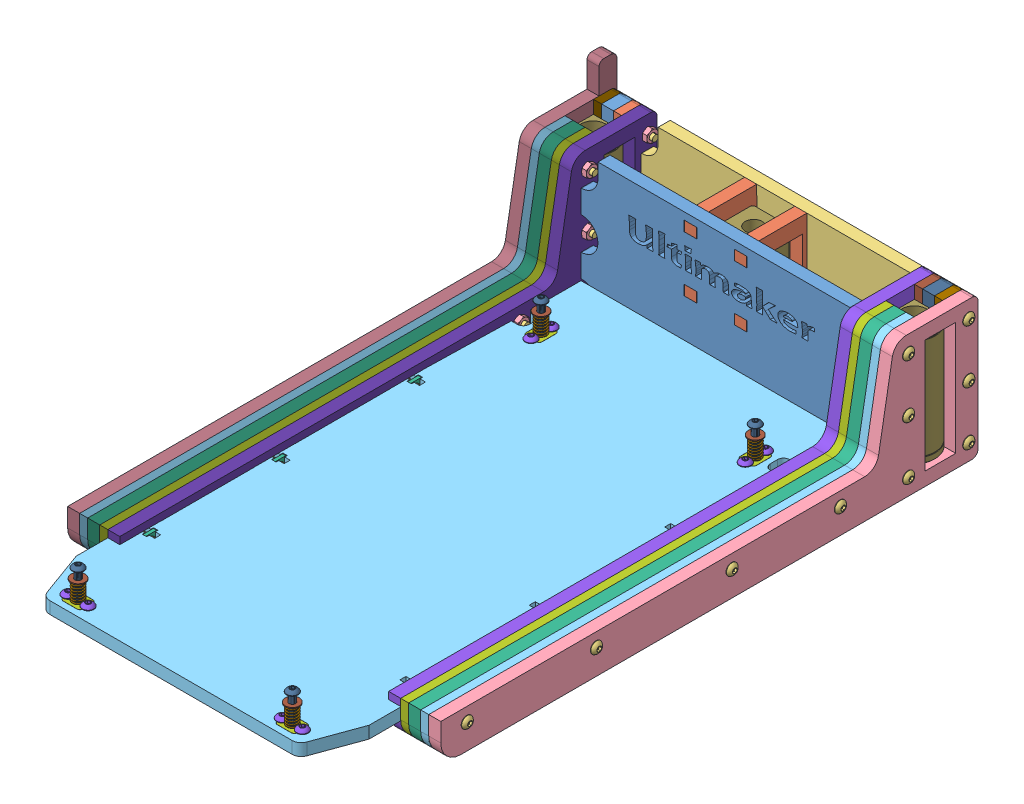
SolidWorks assembly UM_5000_ASM.sldasm, configuration Default (file format 5000). Lengths in mm.
Overall size (242 94.6 322.8).
99 component instances, 31 part files, 0 mates.
Components (placement in the parent):
- UM_5001-1: UM_5001.sldprt [Default] x (-1 0 0) z (0 1 0) size (143 6.01 70)
- UM_5003-1: UM_5003.sldprt [Default] at (12.5 15.05 -16) x (0 1 0) z (0 0 1) size (39.9 6 36)
- UM_5003-2: UM_5003.sldprt [Default] at (-12.5 15.05 -16) x (0 1 0) z (0 0 1) size (39.9 6 36)
- UM_5002-1: UM_5002.sldprt [Default] at (0 0 -30) x (-1 0 0) z (0 1 0) size (143 6 70)
- UM_5100_ASM-1: UM_5100_ASM.sldasm [Default] at (90 -15.7 -16) size (26 70 267.8)
  - UM_5101-1: UM_5101.sldprt [Default] x (0 0 1) z (0 -1 0) size (267.8 6 70)
  - UM_5102-1: UM_5102.sldprt [Default] at (-5 0 0) x (0 0 1) z (0 -1 0) size (241.9 4 70)
  - UM_5103-1: UM_5103.sldprt [Default] at (-10 0 0) x (0 0 1) z (0 -1 0) size (241.9 6 70)
  - UM_5104-1: UM_5104.sldprt [Default] at (-15 0 0) x (0 0 1) z (0 -1 0) size (241.9 4 70)
  - UM_5105-1: UM_5105.sldprt [Default] at (-20 0 0) x (0 0 1) z (0 -1 0) size (267.8 6 70)
  - UM_5106-1: UM_5106.sldprt [Default] at (-5 15.7 0) x (0 0 -1) z (0 -1 0) size (11.7 4 70)
  - UM_5107-1: UM_5107.sldprt [Default] at (-10 15.7 0) x (0 0 -1) z (0 -1 0) size (11.7 6 70)
  - UM_5108-1: UM_5108.sldprt [Default] at (-15 15.7 0) x (0 0 -1) z (0 -1 0) size (11.7 4 70)
  - LINEAR_BALL_BEARING_57X21X12-1: LINEAR_BALL_BEARING_57X21X12.sldprt [Default] at (-10 15.7 0) x (0 1 0) z (0 0 1) size (57 21 21)
- UM_5200_ASM-1: UM_5200_ASM.sldasm [Default] at (-90 -15.85 -16) size (31.9 94.6 267.8)
  - UM_5201-1: UM_5201.sldprt [Default] x (0 0 1) z (0 -1 0) size (267.8 6 94.6)
  - UM_5202-1: UM_5202.sldprt [Default] at (5 0 0) x (0 0 1) z (0 -1 0) size (241.9 4 70)
  - UM_5203-1: UM_5203.sldprt [Default] at (10 0 0) x (0 0 1) z (0 -1 0) size (241.9 6 70)
  - UM_5204-1: UM_5204.sldprt [Default] at (15 0 0) x (0 0 1) z (0 -1 0) size (241.9 4 70)
  - UM_5205-1: UM_5205.sldprt [Default] at (20 0 0) x (0 0 1) z (0 -1 0) size (267.8 6 70)
  - UM_5206-1: UM_5206.sldprt [Default] at (5 15.7 0) x (0 0 -1) z (0 -1 0) size (11.7 4 70)
  - UM_5207-1: UM_5207.sldprt [Default] at (10 15.7 0) x (0 0 -1) z (0 -1 0) size (11.7 6 70)
  - UM_5208-1: UM_5208.sldprt [Default] at (15 15.7 0) x (0 0 -1) z (0 -1 0) size (11.7 4 70)
  - LINEAR_BALL_BEARING_57X21X12-1: LINEAR_BALL_BEARING_57X21X12.sldprt [Default] at (10 15.7 0) x (0 -1 0) z (0 0 -1) size (57 21 21)
  - ISO7380_M3X30-1: ISO7380_M3X30.sldprt [Default] at (-3 42.4 16) x (0 1 0) z (0 0 1) size (5.77 31.9 5.75)
  - ISO7380_M3X30-2: ISO7380_M3X30.sldprt [Default] at (-3 15.7 16) x (0 1 0) z (0 0 1) size (5.77 31.9 5.75)
  - ISO7380_M3X30-3: ISO7380_M3X30.sldprt [Default] at (-3 -11 16) x (0 1 0) z (0 0 1) size (5.77 31.9 5.75)
  - ISO7380_M3X30-4: ISO7380_M3X30.sldprt [Default] at (-3 42.4 -14) x (0 1 0) z (0 0 1) size (5.77 31.9 5.75)
  - ISO7380_M3X30-5: ISO7380_M3X30.sldprt [Default] at (-3 15.7 -14) x (0 1 0) z (0 0 1) size (5.77 31.9 5.75)
  - ISO7380_M3X30-6: ISO7380_M3X30.sldprt [Default] at (-3 -11 -14) x (0 1 0) z (0 0 1) size (5.77 31.9 5.75)
  - DIN934_M3-1: DIN934_M3.sldprt [Default] at (25.4 42.4 16) x (0 -1 0) z (-1 0 0) size (6.35 5.5 2.4)
  - DIN934_M3-2: DIN934_M3.sldprt [Default] at (25.4 42.4 -14.2) x (0 -1 0) z (-1 0 0) size (6.35 5.5 2.4)
  - DIN934_M3-3: DIN934_M3.sldprt [Default] at (25.4 15.7 16) x (0 -1 0) z (-1 0 0) size (6.35 5.5 2.4)
  - DIN934_M3-4: DIN934_M3.sldprt [Default] at (25.4 15.7 -14.2) x (0 -1 0) z (-1 0 0) size (6.35 5.5 2.4)
  - DIN934_M3-5: DIN934_M3.sldprt [Default] at (25.4 -11 16) x (0 -1 0) z (-1 0 0) size (6.35 5.5 2.4)
  - DIN934_M3-6: DIN934_M3.sldprt [Default] at (25.4 -11 -14.2) x (0 -1 0) z (-1 0 0) size (6.35 5.5 2.4)
- UM_5004-1: UM_5004.sldprt [Default] at (0 -22.45 155.5) x (-1 0 0) z (0 0 -1) size (146 6 270.5)
- ISO7380_M3X30-1: ISO7380_M3X30.sldprt [Default] at (93 26.7 0) x (0 -1 0) z (0 0 1) size (5.77 31.9 5.75)
- ISO7380_M3X30-2: ISO7380_M3X30.sldprt [Default] at (93 0 0) x (0 -1 0) z (0 0 1) size (5.77 31.9 5.75)
- ISO7380_M3X30-3: ISO7380_M3X30.sldprt [Default] at (93 -26.7 0) x (0 -1 0) z (0 0 1) size (5.77 31.9 5.75)
- ISO7380_M3X30-4: ISO7380_M3X30.sldprt [Default] at (93 26.7 -30) x (0 -1 0) z (0 0 1) size (5.77 31.9 5.75)
- ISO7380_M3X30-5: ISO7380_M3X30.sldprt [Default] at (93 0 -30) x (0 -1 0) z (0 0 1) size (5.77 31.9 5.75)
- ISO7380_M3X30-6: ISO7380_M3X30.sldprt [Default] at (93 -26.7 -30) x (0 -1 0) z (0 0 1) size (5.77 31.9 5.75)
- DIN562_M3-1: DIN562_M3.sldprt [Default] at (65.8 26.7 0) x (0 -1 0) z (0 0 1) size (5.5 1.6 5.5)
- DIN562_M3-2: DIN562_M3.sldprt [Default] at (65.8 0 0) x (0 -1 0) z (0 0 1) size (5.5 1.6 5.5)
- DIN562_M3-3: DIN562_M3.sldprt [Default] at (65.8 -26.7 0) x (0 -1 0) z (0 0 1) size (5.5 1.6 5.5)
- DIN562_M3-4: DIN562_M3.sldprt [Default] at (65.8 26.7 -30) x (0 -1 0) z (0 0 1) size (5.5 1.6 5.5)
- DIN562_M3-5: DIN562_M3.sldprt [Default] at (65.8 0 -30) x (0 -1 0) z (0 0 1) size (5.5 1.6 5.5)
- DIN562_M3-6: DIN562_M3.sldprt [Default] at (65.8 -26.7 -30) x (0 -1 0) z (0 0 1) size (5.5 1.6 5.5)
- DIN562_M3-7: DIN562_M3.sldprt [Default] at (65.2 -22.35 88) x (0 -1 0) z (0 0 1) size (5.5 1.6 5.5)
- DIN562_M3-8: DIN562_M3.sldprt [Default] at (65.2 -22.35 155.6) x (0 -1 0) z (0 0 1) size (5.5 1.6 5.5)
- DIN562_M3-9: DIN562_M3.sldprt [Default] at (65.2 -22.35 220) x (0 -1 0) z (0 0 1) size (5.5 1.6 5.5)
- DIN562_M3-10: DIN562_M3.sldprt [Default] at (-65.2 -22.45 88) x (0 1 0) z (0 0 1) size (5.5 1.6 5.5)
- DIN562_M3-11: DIN562_M3.sldprt [Default] at (-65.2 -22.45 155.6) x (0 1 0) z (0 0 1) size (5.5 1.6 5.5)
- DIN562_M3-12: DIN562_M3.sldprt [Default] at (-65.2 -22.45 220) x (0 1 0) z (0 0 1) size (5.5 1.6 5.5)
- ISO7380_M3X30-7: ISO7380_M3X30.sldprt [Default] at (93 -22.35 34) x (0 -1 0) z (0 0 1) size (5.77 31.9 5.75)
- ISO7380_M3X30-8: ISO7380_M3X30.sldprt [Default] at (93 -22.35 88) x (0 -1 0) z (0 0 1) size (5.77 31.9 5.75)
- ISO7380_M3X30-9: ISO7380_M3X30.sldprt [Default] at (93 -22.35 155.6) x (0 -1 0) z (0 0 1) size (5.77 31.9 5.75)
- ISO7380_M3X30-10: ISO7380_M3X30.sldprt [Default] at (93 -22.35 220) x (0 -1 0) z (0 0 1) size (5.77 31.9 5.75)
- ISO7380_M3X30-11: ISO7380_M3X30.sldprt [Default] at (-93 -22.45 34) x (0 1 0) z (0 0 1) size (5.77 31.9 5.75)
- ISO7380_M3X30-12: ISO7380_M3X30.sldprt [Default] at (-93 -22.45 88) x (0 1 0) z (0 0 1) size (5.77 31.9 5.75)
- ISO7380_M3X30-13: ISO7380_M3X30.sldprt [Default] at (-93 -22.45 155.6) x (0 1 0) z (0 0 1) size (5.77 31.9 5.75)
- ISO7380_M3X30-14: ISO7380_M3X30.sldprt [Default] at (-93 -22.45 220) x (0 1 0) z (0 0 1) size (5.77 31.9 5.75)
- DIN934_M3-1: DIN934_M3.sldprt [Default] at (67 -22.35 34) x (0 -1 0) z (-1 0 0) size (6.35 5.5 2.4)
- DIN934_M3-2: DIN934_M3.sldprt [Default] at (-67 -22.5 34) x (0 1 0) z (1 0 0) size (6.35 5.5 2.4)
- UM_5005-1: UM_5005.sldprt [Default] at (53.4 -22.45 36.6) x (0 0 1) z (-1 0 0) size (9.9 6 7.9)
- UM_5005-2: UM_5005.sldprt [Default] at (-53.4 -22.45 36.6) x (0 0 1) z (-1 0 0) size (9.9 6 7.9)
- UM_5005-3: UM_5005.sldprt [Default] at (53.4 -22.45 267.4) x (-1 0 0) z (0 0 -1) size (9.9 6 7.9)
- UM_5005-4: UM_5005.sldprt [Default] at (-53.4 -22.45 267.4) x (-1 0 0) z (0 0 -1) size (9.9 6 7.9)
- ISO7380_M3X10-1: ISO7380_M3X10.sldprt [Default] at (53.4 -19.45 31.6) size (5.77 11.9 5.75)
- ISO7380_M3X10-2: ISO7380_M3X10.sldprt [Default] at (53.4 -19.45 41.6) size (5.77 11.9 5.75)
- ISO7380_M3X10-3: ISO7380_M3X10.sldprt [Default] at (-53.4 -19.45 31.6) size (5.77 11.9 5.75)
- ISO7380_M3X10-4: ISO7380_M3X10.sldprt [Default] at (-53.4 -19.45 41.6) size (5.77 11.9 5.75)
- ISO7380_M3X10-5: ISO7380_M3X10.sldprt [Default] at (58.4 -19.45 267.4) size (5.77 11.9 5.75)
- ISO7380_M3X10-6: ISO7380_M3X10.sldprt [Default] at (48.4 -19.45 267.4) size (5.77 11.9 5.75)
- ISO7380_M3X10-7: ISO7380_M3X10.sldprt [Default] at (-48.4 -19.45 267.4) size (5.77 11.9 5.75)
- ISO7380_M3X10-8: ISO7380_M3X10.sldprt [Default] at (-58.4 -19.45 267.4) size (5.77 11.9 5.75)
- DIN934_M3-3: DIN934_M3.sldprt [Default] at (53.4 -27.85 31.6) x (-1 0 0) z (0 1 0) size (6.35 5.5 2.4)
- DIN934_M3-4: DIN934_M3.sldprt [Default] at (53.4 -27.85 41.6) x (-1 0 0) z (0 1 0) size (6.35 5.5 2.4)
- DIN934_M3-5: DIN934_M3.sldprt [Default] at (-53.4 -27.85 31.6) x (-1 0 0) z (0 1 0) size (6.35 5.5 2.4)
- DIN934_M3-6: DIN934_M3.sldprt [Default] at (-53.4 -27.85 41.6) x (-1 0 0) z (0 1 0) size (6.35 5.5 2.4)
- DIN934_M3-7: DIN934_M3.sldprt [Default] at (58.4 -27.85 267.4) x (-1 0 0) z (0 1 0) size (6.35 5.5 2.4)
- DIN934_M3-8: DIN934_M3.sldprt [Default] at (48.4 -27.85 267.4) x (-1 0 0) z (0 1 0) size (6.35 5.5 2.4)
- DIN934_M3-9: DIN934_M3.sldprt [Default] at (-48.4 -27.85 267.4) x (-1 0 0) z (0 1 0) size (6.35 5.5 2.4)
- DIN934_M3-10: DIN934_M3.sldprt [Default] at (-58.4 -27.85 267.4) x (-1 0 0) z (0 1 0) size (6.35 5.5 2.4)
- D11450-1: D11450.sldprt [Default] at (53.4 -14.9 36.6) x (0 -1 0) z (0 0 1) size (9.18 5.73 5.73)
- ISO7380_M3X20-1: ISO7380_M3X20.sldprt [Default] at (53.4 -5.45 36.6) size (5.77 21.9 5.75)
- DIN125A_M3-1: DIN125A_M3.sldprt [Default] at (53.4 -10.05 36.6) x (-1 0 0) z (0 0 1) size (7 0.5 7)
- D11450-2: D11450.sldprt [Default] at (-53.4 -14.9 36.6) x (0 -1 0) z (0 0 1) size (9.18 5.73 5.73)
- ISO7380_M3X20-2: ISO7380_M3X20.sldprt [Default] at (-53.4 -5.45 36.6) size (5.77 21.9 5.75)
- DIN125A_M3-2: DIN125A_M3.sldprt [Default] at (-53.4 -10.05 36.6) x (-1 0 0) z (0 0 1) size (7 0.5 7)
- D11450-3: D11450.sldprt [Default] at (53.4 -14.9 267.4) x (0 -1 0) z (0 0 1) size (9.18 5.73 5.73)
- ISO7380_M3X20-3: ISO7380_M3X20.sldprt [Default] at (53.4 -5.45 267.4) size (5.77 21.9 5.75)
- DIN125A_M3-3: DIN125A_M3.sldprt [Default] at (53.4 -10.05 267.4) x (-1 0 0) z (0 0 1) size (7 0.5 7)
- D11450-4: D11450.sldprt [Default] at (-53.4 -14.9 267.4) x (0 -1 0) z (0 0 1) size (9.18 5.73 5.73)
- ISO7380_M3X20-4: ISO7380_M3X20.sldprt [Default] at (-53.4 -5.45 267.4) size (5.77 21.9 5.75)
- DIN125A_M3-4: DIN125A_M3.sldprt [Default] at (-53.4 -10.05 267.4) x (-1 0 0) z (0 0 1) size (7 0.5 7)
- tafel steun2-1: tafel steun2.SLDPRT [Default] at (0 -8.25 152) size (242 6 257)
- UM_5007-1: UM_5007.sldprt [Default] at (0 15.05 -16) size (25 24 18)
